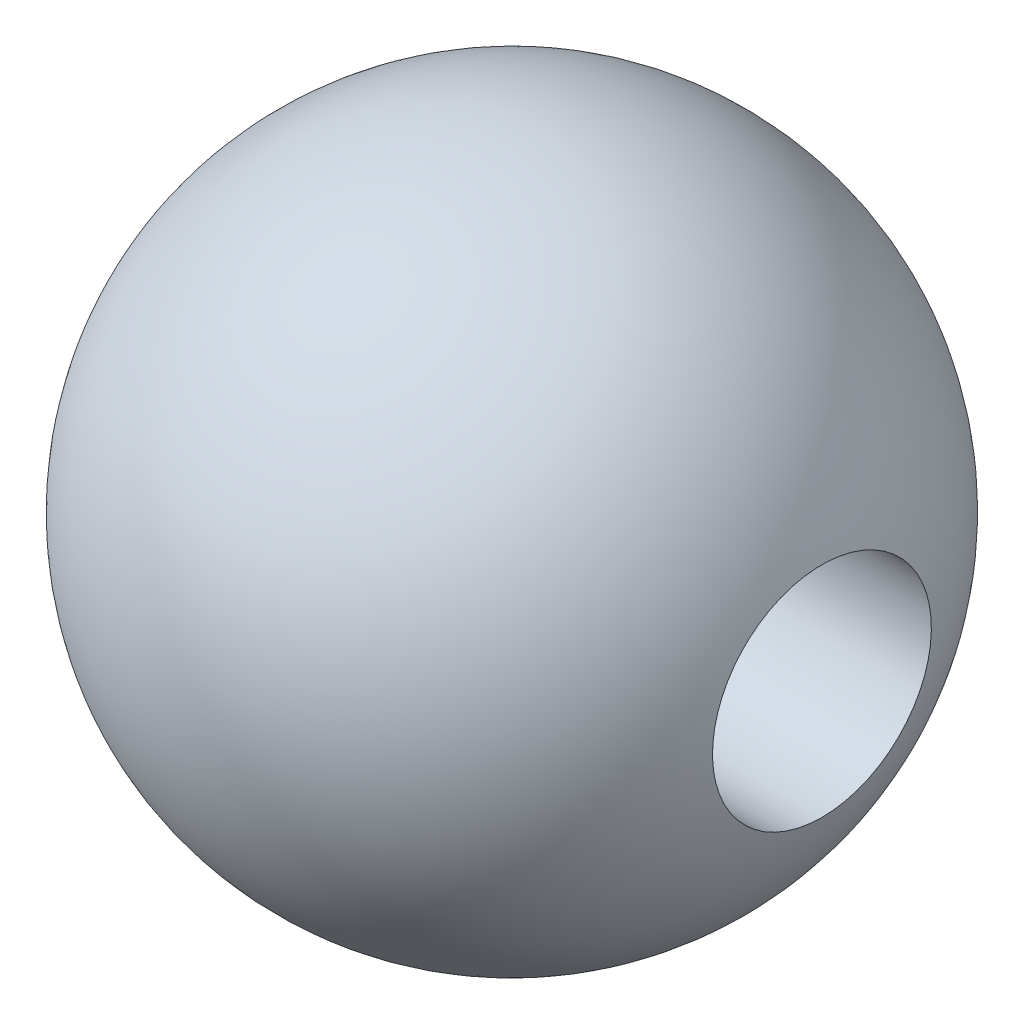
from build123d import *


with BuildPart() as part:
    # Sketch1 → Revolve1 (revolve)
    with BuildSketch(Plane.XY, mode=Mode.PRIVATE) as revolve1_sk:
        with BuildLine():
            Line((-11, 3), (-10, 2))
            Line((-10, 2), (-0.123678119, 2))
            ThreePointArc((-0.123678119, 2), (-5.240039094, 6), (-11, 3))
        make_face()
    revolve(revolve1_sk.sketch.rotate(Axis((-11, 0, 0), (1, 0, 0)), 180), axis=Axis((-11, 0, 0), (1, 0, 0)))


solid = part.part
